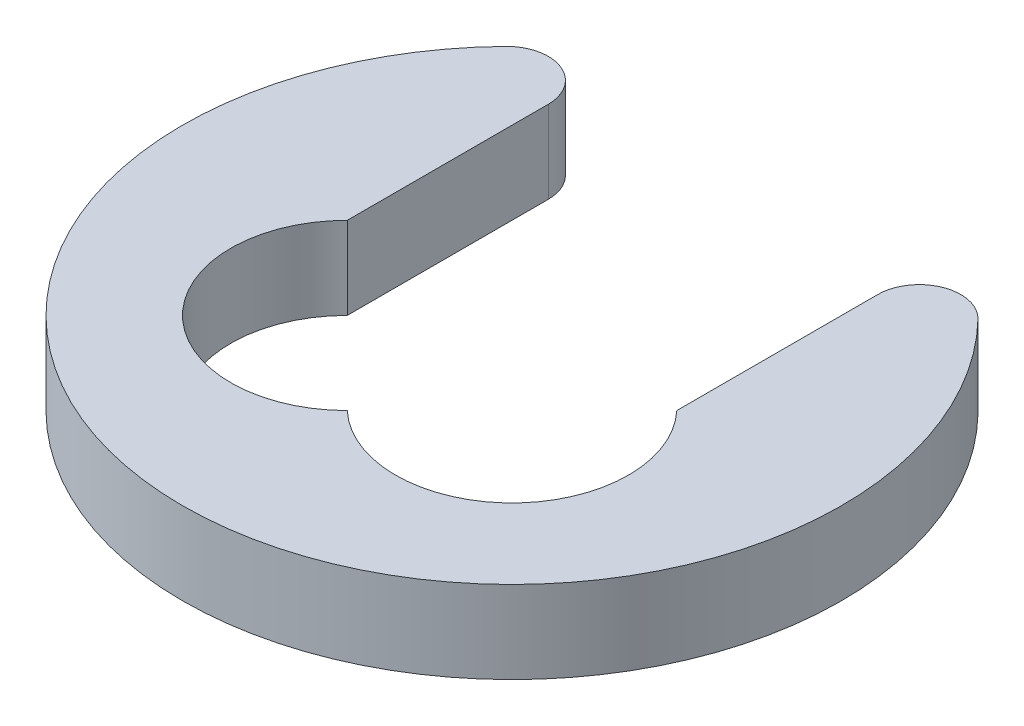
ISO-10303-21;
HEADER;
FILE_DESCRIPTION(('STEP AP214'),'2;1');
FILE_NAME('part.step','',(''),(''),'','','');
FILE_SCHEMA(('AUTOMOTIVE_DESIGN { 1 0 10303 214 1 1 1 1 }'));
ENDSEC;
DATA;
#1=APPLICATION_CONTEXT('core data for automotive mechanical design processes');
#2=APPLICATION_PROTOCOL_DEFINITION('international standard','automotive_design',2000,#1);
#3=PRODUCT_CONTEXT('',#1,'mechanical');
#4=PRODUCT('Part','Part','',(#3));
#5=PRODUCT_RELATED_PRODUCT_CATEGORY('part','',(#4));
#6=PRODUCT_DEFINITION_FORMATION('','',#4);
#7=PRODUCT_DEFINITION_CONTEXT('part definition',#1,'design');
#8=PRODUCT_DEFINITION('design','',#6,#7);
#9=PRODUCT_DEFINITION_SHAPE('','',#8);
#10=(LENGTH_UNIT() NAMED_UNIT(*) SI_UNIT(.MILLI.,.METRE.));
#11=(NAMED_UNIT(*) PLANE_ANGLE_UNIT() SI_UNIT($,.RADIAN.));
#12=(NAMED_UNIT(*) SI_UNIT($,.STERADIAN.) SOLID_ANGLE_UNIT());
#13=UNCERTAINTY_MEASURE_WITH_UNIT(LENGTH_MEASURE(1.E-05),#10,'distance_accuracy_value','');
#14=(GEOMETRIC_REPRESENTATION_CONTEXT(3) GLOBAL_UNCERTAINTY_ASSIGNED_CONTEXT((#13)) GLOBAL_UNIT_ASSIGNED_CONTEXT((#10,
#11,#12)) REPRESENTATION_CONTEXT('',''));
#15=CARTESIAN_POINT('',(0.,0.,0.));
#16=DIRECTION('',(0.,0.,1.));
#17=DIRECTION('',(1.,0.,0.));
#18=AXIS2_PLACEMENT_3D('',#15,#16,#17);
#19=CARTESIAN_POINT('',(0.,0.79375,0.));
#20=DIRECTION('',(0.,1.,0.));
#21=DIRECTION('',(0.,0.,-1.));
#22=AXIS2_PLACEMENT_3D('',#19,#20,#21);
#23=PLANE('',#22);
#24=CARTESIAN_POINT('',(0.770827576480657,0.79375,0.770827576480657));
#25=DIRECTION('',(0.,1.,0.));
#26=DIRECTION('',(0.,0.,1.));
#27=AXIS2_PLACEMENT_3D('',#24,#25,#26);
#28=CIRCLE('',#27,1.123);
#29=CARTESIAN_POINT('',(0.,0.79375,1.5875));
#30=VERTEX_POINT('',#29);
#31=CARTESIAN_POINT('',(1.5875,0.79375,0.));
#32=VERTEX_POINT('',#31);
#33=EDGE_CURVE('E119',#30,#32,#28,.T.);
#34=ORIENTED_EDGE('',*,*,#33,.F.);
#35=CARTESIAN_POINT('',(-0.79375,0.79375,0.79375));
#36=DIRECTION('',(0.,1.,0.));
#37=DIRECTION('',(0.,0.,1.));
#38=AXIS2_PLACEMENT_3D('',#35,#36,#37);
#39=CIRCLE('',#38,1.12253201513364);
#40=CARTESIAN_POINT('',(-1.5875,0.79375,0.));
#41=VERTEX_POINT('',#40);
#42=EDGE_CURVE('E114',#41,#30,#39,.T.);
#43=ORIENTED_EDGE('',*,*,#42,.F.);
#44=DIRECTION('',(0.,0.,-1.));
#45=VECTOR('',#44,1.);
#46=CARTESIAN_POINT('',(-1.5875,0.79375,-2.74963065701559));
#47=LINE('',#46,#45);
#48=CARTESIAN_POINT('',(-1.5875,0.79375,-1.9366127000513));
#49=VERTEX_POINT('',#48);
#50=EDGE_CURVE('E134',#49,#41,#47,.F.);
#51=ORIENTED_EDGE('',*,*,#50,.F.);
#52=CARTESIAN_POINT('',(-1.9875,0.79375,-1.9366127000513));
#53=DIRECTION('',(0.,-1.,0.));
#54=DIRECTION('',(0.,0.,-1.));
#55=AXIS2_PLACEMENT_3D('',#52,#53,#54);
#56=CIRCLE('',#55,0.4);
#57=CARTESIAN_POINT('',(-2.27398648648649,0.79375,-2.21576408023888));
#58=VERTEX_POINT('',#57);
#59=EDGE_CURVE('E110',#49,#58,#56,.F.);
#60=ORIENTED_EDGE('',*,*,#59,.T.);
#61=CARTESIAN_POINT('',(0.,0.79375,0.));
#62=DIRECTION('',(0.,-1.,0.));
#63=DIRECTION('',(0.,0.,-1.));
#64=AXIS2_PLACEMENT_3D('',#61,#62,#63);
#65=CIRCLE('',#64,3.175);
#66=CARTESIAN_POINT('',(2.27398648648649,0.79375,-2.21576408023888));
#67=VERTEX_POINT('',#66);
#68=EDGE_CURVE('E97',#58,#67,#65,.F.);
#69=ORIENTED_EDGE('',*,*,#68,.T.);
#70=CARTESIAN_POINT('',(1.9875,0.79375,-1.9366127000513));
#71=DIRECTION('',(0.,1.,0.));
#72=DIRECTION('',(0.,0.,1.));
#73=AXIS2_PLACEMENT_3D('',#70,#71,#72);
#74=CIRCLE('',#73,0.4);
#75=CARTESIAN_POINT('',(1.5875,0.79375,-1.9366127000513));
#76=VERTEX_POINT('',#75);
#77=EDGE_CURVE('E38',#76,#67,#74,.F.);
#78=ORIENTED_EDGE('',*,*,#77,.F.);
#79=DIRECTION('',(0.,0.,1.));
#80=VECTOR('',#79,1.);
#81=CARTESIAN_POINT('',(1.5875,0.79375,0.));
#82=LINE('',#81,#80);
#83=EDGE_CURVE('E101',#32,#76,#82,.F.);
#84=ORIENTED_EDGE('',*,*,#83,.F.);
#85=EDGE_LOOP('',(#34,#43,#51,#60,#69,#78,#84));
#86=FACE_BOUND('',#85,.T.);
#87=ADVANCED_FACE('F35',(#86),#23,.T.);
#88=CARTESIAN_POINT('',(0.,0.,0.));
#89=DIRECTION('',(0.,1.,0.));
#90=DIRECTION('',(0.,0.,-1.));
#91=AXIS2_PLACEMENT_3D('',#88,#89,#90);
#92=CYLINDRICAL_SURFACE('',#91,3.175);
#93=DIRECTION('',(0.,1.,0.));
#94=VECTOR('',#93,1.);
#95=CARTESIAN_POINT('',(-2.27398648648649,0.,-2.21576408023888));
#96=LINE('',#95,#94);
#97=CARTESIAN_POINT('',(-2.27398648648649,0.,-2.21576408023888));
#98=VERTEX_POINT('',#97);
#99=EDGE_CURVE('E111',#58,#98,#96,.F.);
#100=ORIENTED_EDGE('',*,*,#99,.T.);
#101=CARTESIAN_POINT('',(0.,0.,0.));
#102=DIRECTION('',(0.,-1.,0.));
#103=DIRECTION('',(0.,0.,-1.));
#104=AXIS2_PLACEMENT_3D('',#101,#102,#103);
#105=CIRCLE('',#104,3.175);
#106=CARTESIAN_POINT('',(2.27398648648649,0.,-2.21576408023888));
#107=VERTEX_POINT('',#106);
#108=EDGE_CURVE('E100',#107,#98,#105,.T.);
#109=ORIENTED_EDGE('',*,*,#108,.F.);
#110=DIRECTION('',(0.,-1.,0.));
#111=VECTOR('',#110,1.);
#112=CARTESIAN_POINT('',(2.27398648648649,0.,-2.21576408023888));
#113=LINE('',#112,#111);
#114=EDGE_CURVE('E93',#107,#67,#113,.F.);
#115=ORIENTED_EDGE('',*,*,#114,.T.);
#116=ORIENTED_EDGE('',*,*,#68,.F.);
#117=EDGE_LOOP('',(#100,#109,#115,#116));
#118=FACE_BOUND('',#117,.T.);
#119=ADVANCED_FACE('F95',(#118),#92,.T.);
#120=CARTESIAN_POINT('',(-1.9875,0.,-1.9366127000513));
#121=DIRECTION('',(0.,1.,0.));
#122=DIRECTION('',(0.,0.,-1.));
#123=AXIS2_PLACEMENT_3D('',#120,#121,#122);
#124=CYLINDRICAL_SURFACE('',#123,0.4);
#125=CARTESIAN_POINT('',(-1.9875,0.,-1.9366127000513));
#126=DIRECTION('',(0.,-1.,0.));
#127=DIRECTION('',(0.,0.,-1.));
#128=AXIS2_PLACEMENT_3D('',#125,#126,#127);
#129=CIRCLE('',#128,0.4);
#130=CARTESIAN_POINT('',(-1.5875,0.,-1.9366127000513));
#131=VERTEX_POINT('',#130);
#132=EDGE_CURVE('E124',#98,#131,#129,.T.);
#133=ORIENTED_EDGE('',*,*,#132,.F.);
#134=ORIENTED_EDGE('',*,*,#99,.F.);
#135=ORIENTED_EDGE('',*,*,#59,.F.);
#136=DIRECTION('',(0.,1.,0.));
#137=VECTOR('',#136,1.);
#138=CARTESIAN_POINT('',(-1.5875,0.79375,-1.9366127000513));
#139=LINE('',#138,#137);
#140=EDGE_CURVE('E137',#131,#49,#139,.T.);
#141=ORIENTED_EDGE('',*,*,#140,.F.);
#142=EDGE_LOOP('',(#133,#134,#135,#141));
#143=FACE_BOUND('',#142,.T.);
#144=ADVANCED_FACE('F163',(#143),#124,.T.);
#145=CARTESIAN_POINT('',(-1.5875,0.79375,-2.74963065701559));
#146=DIRECTION('',(-1.,0.,0.));
#147=DIRECTION('',(0.,0.,-1.));
#148=AXIS2_PLACEMENT_3D('',#145,#146,#147);
#149=PLANE('',#148);
#150=DIRECTION('',(0.,0.,-1.));
#151=VECTOR('',#150,1.);
#152=CARTESIAN_POINT('',(-1.5875,0.,0.));
#153=LINE('',#152,#151);
#154=CARTESIAN_POINT('',(-1.5875,0.,0.));
#155=VERTEX_POINT('',#154);
#156=EDGE_CURVE('E127',#131,#155,#153,.F.);
#157=ORIENTED_EDGE('',*,*,#156,.F.);
#158=ORIENTED_EDGE('',*,*,#140,.T.);
#159=ORIENTED_EDGE('',*,*,#50,.T.);
#160=DIRECTION('',(0.,-1.,0.));
#161=VECTOR('',#160,1.);
#162=CARTESIAN_POINT('',(-1.5875,0.79375,0.));
#163=LINE('',#162,#161);
#164=EDGE_CURVE('E118',#155,#41,#163,.F.);
#165=ORIENTED_EDGE('',*,*,#164,.F.);
#166=EDGE_LOOP('',(#157,#158,#159,#165));
#167=FACE_BOUND('',#166,.T.);
#168=ADVANCED_FACE('F160',(#167),#149,.F.);
#169=CARTESIAN_POINT('',(-0.79375,0.79375,0.79375));
#170=DIRECTION('',(0.,-1.,0.));
#171=DIRECTION('',(0.,0.,1.));
#172=AXIS2_PLACEMENT_3D('',#169,#170,#171);
#173=CYLINDRICAL_SURFACE('',#172,1.12253201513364);
#174=ORIENTED_EDGE('',*,*,#164,.T.);
#175=ORIENTED_EDGE('',*,*,#42,.T.);
#176=DIRECTION('',(0.,-1.,0.));
#177=VECTOR('',#176,1.);
#178=CARTESIAN_POINT('',(0.,0.79375,1.5875));
#179=LINE('',#178,#177);
#180=CARTESIAN_POINT('',(0.,0.,1.5875));
#181=VERTEX_POINT('',#180);
#182=EDGE_CURVE('E117',#181,#30,#179,.F.);
#183=ORIENTED_EDGE('',*,*,#182,.F.);
#184=CARTESIAN_POINT('',(-0.79375,0.,0.79375));
#185=DIRECTION('',(0.,1.,0.));
#186=DIRECTION('',(0.,0.,1.));
#187=AXIS2_PLACEMENT_3D('',#184,#185,#186);
#188=CIRCLE('',#187,1.12253201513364);
#189=EDGE_CURVE('E128',#155,#181,#188,.T.);
#190=ORIENTED_EDGE('',*,*,#189,.F.);
#191=EDGE_LOOP('',(#174,#175,#183,#190));
#192=FACE_BOUND('',#191,.T.);
#193=ADVANCED_FACE('F157',(#192),#173,.F.);
#194=CARTESIAN_POINT('',(0.770827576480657,0.79375,0.770827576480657));
#195=DIRECTION('',(0.,-1.,0.));
#196=DIRECTION('',(0.,0.,1.));
#197=AXIS2_PLACEMENT_3D('',#194,#195,#196);
#198=CYLINDRICAL_SURFACE('',#197,1.123);
#199=ORIENTED_EDGE('',*,*,#182,.T.);
#200=ORIENTED_EDGE('',*,*,#33,.T.);
#201=DIRECTION('',(0.,1.,0.));
#202=VECTOR('',#201,1.);
#203=CARTESIAN_POINT('',(1.5875,0.79375,0.));
#204=LINE('',#203,#202);
#205=CARTESIAN_POINT('',(1.5875,0.,0.));
#206=VERTEX_POINT('',#205);
#207=EDGE_CURVE('E122',#206,#32,#204,.T.);
#208=ORIENTED_EDGE('',*,*,#207,.F.);
#209=CARTESIAN_POINT('',(0.770827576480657,0.,0.770827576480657));
#210=DIRECTION('',(0.,1.,0.));
#211=DIRECTION('',(0.,0.,1.));
#212=AXIS2_PLACEMENT_3D('',#209,#210,#211);
#213=CIRCLE('',#212,1.123);
#214=EDGE_CURVE('E131',#181,#206,#213,.T.);
#215=ORIENTED_EDGE('',*,*,#214,.F.);
#216=EDGE_LOOP('',(#199,#200,#208,#215));
#217=FACE_BOUND('',#216,.T.);
#218=ADVANCED_FACE('F154',(#217),#198,.F.);
#219=CARTESIAN_POINT('',(1.5875,0.79375,0.));
#220=DIRECTION('',(1.,0.,0.));
#221=DIRECTION('',(0.,0.,1.));
#222=AXIS2_PLACEMENT_3D('',#219,#220,#221);
#223=PLANE('',#222);
#224=ORIENTED_EDGE('',*,*,#83,.T.);
#225=DIRECTION('',(0.,-1.,0.));
#226=VECTOR('',#225,1.);
#227=CARTESIAN_POINT('',(1.5875,0.,-1.9366127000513));
#228=LINE('',#227,#226);
#229=CARTESIAN_POINT('',(1.5875,0.,-1.9366127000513));
#230=VERTEX_POINT('',#229);
#231=EDGE_CURVE('E87',#76,#230,#228,.T.);
#232=ORIENTED_EDGE('',*,*,#231,.T.);
#233=DIRECTION('',(0.,0.,-1.));
#234=VECTOR('',#233,1.);
#235=CARTESIAN_POINT('',(1.5875,0.,0.));
#236=LINE('',#235,#234);
#237=EDGE_CURVE('E44',#206,#230,#236,.T.);
#238=ORIENTED_EDGE('',*,*,#237,.F.);
#239=ORIENTED_EDGE('',*,*,#207,.T.);
#240=EDGE_LOOP('',(#224,#232,#238,#239));
#241=FACE_BOUND('',#240,.T.);
#242=ADVANCED_FACE('F151',(#241),#223,.F.);
#243=CARTESIAN_POINT('',(1.9875,0.,-1.9366127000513));
#244=DIRECTION('',(0.,-1.,0.));
#245=DIRECTION('',(0.,0.,1.));
#246=AXIS2_PLACEMENT_3D('',#243,#244,#245);
#247=CYLINDRICAL_SURFACE('',#246,0.4);
#248=ORIENTED_EDGE('',*,*,#77,.T.);
#249=ORIENTED_EDGE('',*,*,#114,.F.);
#250=CARTESIAN_POINT('',(1.9875,0.,-1.9366127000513));
#251=DIRECTION('',(0.,1.,0.));
#252=DIRECTION('',(0.,0.,1.));
#253=AXIS2_PLACEMENT_3D('',#250,#251,#252);
#254=CIRCLE('',#253,0.4);
#255=EDGE_CURVE('E11',#230,#107,#254,.F.);
#256=ORIENTED_EDGE('',*,*,#255,.F.);
#257=ORIENTED_EDGE('',*,*,#231,.F.);
#258=EDGE_LOOP('',(#248,#249,#256,#257));
#259=FACE_BOUND('',#258,.T.);
#260=ADVANCED_FACE('F104',(#259),#247,.T.);
#261=CARTESIAN_POINT('',(0.,0.,0.));
#262=DIRECTION('',(0.,1.,0.));
#263=DIRECTION('',(0.,0.,-1.));
#264=AXIS2_PLACEMENT_3D('',#261,#262,#263);
#265=PLANE('',#264);
#266=ORIENTED_EDGE('',*,*,#237,.T.);
#267=ORIENTED_EDGE('',*,*,#255,.T.);
#268=ORIENTED_EDGE('',*,*,#108,.T.);
#269=ORIENTED_EDGE('',*,*,#132,.T.);
#270=ORIENTED_EDGE('',*,*,#156,.T.);
#271=ORIENTED_EDGE('',*,*,#189,.T.);
#272=ORIENTED_EDGE('',*,*,#214,.T.);
#273=EDGE_LOOP('',(#266,#267,#268,#269,#270,#271,#272));
#274=FACE_BOUND('',#273,.T.);
#275=ADVANCED_FACE('F148',(#274),#265,.F.);
#276=CLOSED_SHELL('',(#87,#119,#144,#168,#193,#218,#242,#260,#275));
#277=MANIFOLD_SOLID_BREP('B2',#276);
#278=ADVANCED_BREP_SHAPE_REPRESENTATION('',(#18,#277),#14);
#279=SHAPE_DEFINITION_REPRESENTATION(#9,#278);
ENDSEC;
END-ISO-10303-21;
